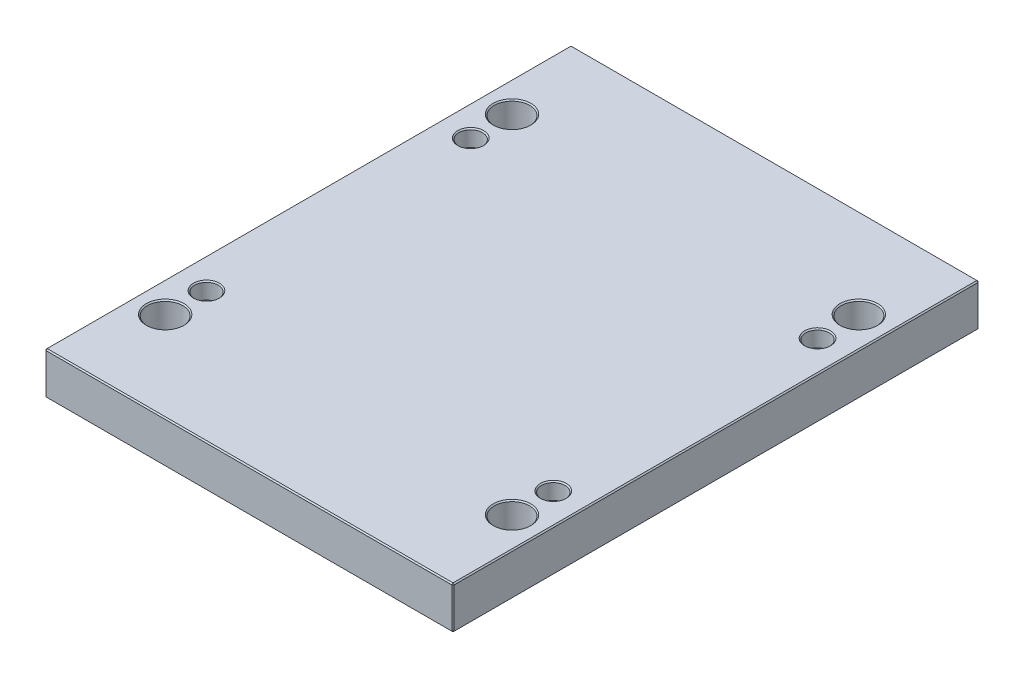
ISO-10303-21;
HEADER;
FILE_DESCRIPTION(('STEP AP214'),'2;1');
FILE_NAME('part.step','',(''),(''),'','','');
FILE_SCHEMA(('AUTOMOTIVE_DESIGN { 1 0 10303 214 1 1 1 1 }'));
ENDSEC;
DATA;
#1=APPLICATION_CONTEXT('core data for automotive mechanical design processes');
#2=APPLICATION_PROTOCOL_DEFINITION('international standard','automotive_design',2000,#1);
#3=PRODUCT_CONTEXT('',#1,'mechanical');
#4=PRODUCT('Part','Part','',(#3));
#5=PRODUCT_RELATED_PRODUCT_CATEGORY('part','',(#4));
#6=PRODUCT_DEFINITION_FORMATION('','',#4);
#7=PRODUCT_DEFINITION_CONTEXT('part definition',#1,'design');
#8=PRODUCT_DEFINITION('design','',#6,#7);
#9=PRODUCT_DEFINITION_SHAPE('','',#8);
#10=(LENGTH_UNIT() NAMED_UNIT(*) SI_UNIT(.MILLI.,.METRE.));
#11=(NAMED_UNIT(*) PLANE_ANGLE_UNIT() SI_UNIT($,.RADIAN.));
#12=(NAMED_UNIT(*) SI_UNIT($,.STERADIAN.) SOLID_ANGLE_UNIT());
#13=UNCERTAINTY_MEASURE_WITH_UNIT(LENGTH_MEASURE(1.E-05),#10,'distance_accuracy_value','');
#14=(GEOMETRIC_REPRESENTATION_CONTEXT(3) GLOBAL_UNCERTAINTY_ASSIGNED_CONTEXT((#13)) GLOBAL_UNIT_ASSIGNED_CONTEXT((#10,
#11,#12)) REPRESENTATION_CONTEXT('',''));
#15=CARTESIAN_POINT('',(0.,0.,0.));
#16=DIRECTION('',(0.,0.,1.));
#17=DIRECTION('',(1.,0.,0.));
#18=AXIS2_PLACEMENT_3D('',#15,#16,#17);
#19=CARTESIAN_POINT('',(-173.,36.,223.));
#20=DIRECTION('',(1.,0.,0.));
#21=DIRECTION('',(0.,0.,-1.));
#22=AXIS2_PLACEMENT_3D('',#19,#20,#21);
#23=PLANE('',#22);
#24=DIRECTION('',(0.,-1.,0.));
#25=VECTOR('',#24,1.);
#26=CARTESIAN_POINT('',(-173.,36.,-222.));
#27=LINE('',#26,#25);
#28=CARTESIAN_POINT('',(-173.,35.,-222.));
#29=VERTEX_POINT('',#28);
#30=CARTESIAN_POINT('',(-173.,1.,-222.));
#31=VERTEX_POINT('',#30);
#32=EDGE_CURVE('E115',#29,#31,#27,.T.);
#33=ORIENTED_EDGE('',*,*,#32,.T.);
#34=DIRECTION('',(0.,0.,1.));
#35=VECTOR('',#34,1.);
#36=CARTESIAN_POINT('',(-173.,1.,223.));
#37=LINE('',#36,#35);
#38=CARTESIAN_POINT('',(-173.,1.,222.));
#39=VERTEX_POINT('',#38);
#40=EDGE_CURVE('E111',#31,#39,#37,.T.);
#41=ORIENTED_EDGE('',*,*,#40,.T.);
#42=DIRECTION('',(0.,1.,0.));
#43=VECTOR('',#42,1.);
#44=CARTESIAN_POINT('',(-173.,36.,222.));
#45=LINE('',#44,#43);
#46=CARTESIAN_POINT('',(-173.,35.,222.));
#47=VERTEX_POINT('',#46);
#48=EDGE_CURVE('E104',#39,#47,#45,.T.);
#49=ORIENTED_EDGE('',*,*,#48,.T.);
#50=DIRECTION('',(0.,0.,-1.));
#51=VECTOR('',#50,1.);
#52=CARTESIAN_POINT('',(-173.,35.,-223.));
#53=LINE('',#52,#51);
#54=EDGE_CURVE('E108',#47,#29,#53,.T.);
#55=ORIENTED_EDGE('',*,*,#54,.T.);
#56=EDGE_LOOP('',(#33,#41,#49,#55));
#57=FACE_BOUND('',#56,.T.);
#58=ADVANCED_FACE('F16',(#57),#23,.F.);
#59=CARTESIAN_POINT('',(173.,36.,223.));
#60=DIRECTION('',(0.,0.,-1.));
#61=DIRECTION('',(-1.,0.,0.));
#62=AXIS2_PLACEMENT_3D('',#59,#60,#61);
#63=PLANE('',#62);
#64=DIRECTION('',(-1.,0.,0.));
#65=VECTOR('',#64,1.);
#66=CARTESIAN_POINT('',(-173.,35.,223.));
#67=LINE('',#66,#65);
#68=CARTESIAN_POINT('',(172.,35.,223.));
#69=VERTEX_POINT('',#68);
#70=CARTESIAN_POINT('',(-172.,35.,223.));
#71=VERTEX_POINT('',#70);
#72=EDGE_CURVE('E170',#69,#71,#67,.T.);
#73=ORIENTED_EDGE('',*,*,#72,.T.);
#74=DIRECTION('',(0.,-1.,0.));
#75=VECTOR('',#74,1.);
#76=CARTESIAN_POINT('',(-172.,36.,223.));
#77=LINE('',#76,#75);
#78=CARTESIAN_POINT('',(-172.,1.,223.));
#79=VERTEX_POINT('',#78);
#80=EDGE_CURVE('E123',#71,#79,#77,.T.);
#81=ORIENTED_EDGE('',*,*,#80,.T.);
#82=DIRECTION('',(1.,0.,0.));
#83=VECTOR('',#82,1.);
#84=CARTESIAN_POINT('',(173.,1.,223.));
#85=LINE('',#84,#83);
#86=CARTESIAN_POINT('',(172.,1.,223.));
#87=VERTEX_POINT('',#86);
#88=EDGE_CURVE('E174',#79,#87,#85,.T.);
#89=ORIENTED_EDGE('',*,*,#88,.T.);
#90=DIRECTION('',(0.,1.,0.));
#91=VECTOR('',#90,1.);
#92=CARTESIAN_POINT('',(172.,36.,223.));
#93=LINE('',#92,#91);
#94=EDGE_CURVE('E172',#87,#69,#93,.T.);
#95=ORIENTED_EDGE('',*,*,#94,.T.);
#96=EDGE_LOOP('',(#73,#81,#89,#95));
#97=FACE_BOUND('',#96,.T.);
#98=ADVANCED_FACE('F413',(#97),#63,.F.);
#99=CARTESIAN_POINT('',(173.,36.,223.));
#100=DIRECTION('',(-1.,0.,0.));
#101=DIRECTION('',(0.,0.,1.));
#102=AXIS2_PLACEMENT_3D('',#99,#100,#101);
#103=PLANE('',#102);
#104=DIRECTION('',(0.,0.,-1.));
#105=VECTOR('',#104,1.);
#106=CARTESIAN_POINT('',(173.,1.,223.));
#107=LINE('',#106,#105);
#108=CARTESIAN_POINT('',(173.,1.,222.));
#109=VERTEX_POINT('',#108);
#110=CARTESIAN_POINT('',(173.,1.,-222.));
#111=VERTEX_POINT('',#110);
#112=EDGE_CURVE('E165',#109,#111,#107,.T.);
#113=ORIENTED_EDGE('',*,*,#112,.T.);
#114=DIRECTION('',(0.,1.,0.));
#115=VECTOR('',#114,1.);
#116=CARTESIAN_POINT('',(173.,36.,-222.));
#117=LINE('',#116,#115);
#118=CARTESIAN_POINT('',(173.,35.,-222.));
#119=VERTEX_POINT('',#118);
#120=EDGE_CURVE('E167',#111,#119,#117,.T.);
#121=ORIENTED_EDGE('',*,*,#120,.T.);
#122=DIRECTION('',(0.,0.,1.));
#123=VECTOR('',#122,1.);
#124=CARTESIAN_POINT('',(173.,35.,223.));
#125=LINE('',#124,#123);
#126=CARTESIAN_POINT('',(173.,35.,222.));
#127=VERTEX_POINT('',#126);
#128=EDGE_CURVE('E161',#119,#127,#125,.T.);
#129=ORIENTED_EDGE('',*,*,#128,.T.);
#130=DIRECTION('',(0.,-1.,0.));
#131=VECTOR('',#130,1.);
#132=CARTESIAN_POINT('',(173.,36.,222.));
#133=LINE('',#132,#131);
#134=EDGE_CURVE('E163',#127,#109,#133,.T.);
#135=ORIENTED_EDGE('',*,*,#134,.T.);
#136=EDGE_LOOP('',(#113,#121,#129,#135));
#137=FACE_BOUND('',#136,.T.);
#138=ADVANCED_FACE('F406',(#137),#103,.F.);
#139=CARTESIAN_POINT('',(173.,36.,-223.));
#140=DIRECTION('',(0.,0.,1.));
#141=DIRECTION('',(1.,0.,0.));
#142=AXIS2_PLACEMENT_3D('',#139,#140,#141);
#143=PLANE('',#142);
#144=DIRECTION('',(0.,-1.,0.));
#145=VECTOR('',#144,1.);
#146=CARTESIAN_POINT('',(172.,36.,-223.));
#147=LINE('',#146,#145);
#148=CARTESIAN_POINT('',(172.,35.,-223.));
#149=VERTEX_POINT('',#148);
#150=CARTESIAN_POINT('',(172.,1.,-223.));
#151=VERTEX_POINT('',#150);
#152=EDGE_CURVE('E154',#149,#151,#147,.T.);
#153=ORIENTED_EDGE('',*,*,#152,.T.);
#154=DIRECTION('',(-1.,0.,0.));
#155=VECTOR('',#154,1.);
#156=CARTESIAN_POINT('',(173.,1.,-223.));
#157=LINE('',#156,#155);
#158=CARTESIAN_POINT('',(-172.,1.,-223.));
#159=VERTEX_POINT('',#158);
#160=EDGE_CURVE('E159',#151,#159,#157,.T.);
#161=ORIENTED_EDGE('',*,*,#160,.T.);
#162=DIRECTION('',(0.,1.,0.));
#163=VECTOR('',#162,1.);
#164=CARTESIAN_POINT('',(-172.,36.,-223.));
#165=LINE('',#164,#163);
#166=CARTESIAN_POINT('',(-172.,35.,-223.));
#167=VERTEX_POINT('',#166);
#168=EDGE_CURVE('E156',#159,#167,#165,.T.);
#169=ORIENTED_EDGE('',*,*,#168,.T.);
#170=DIRECTION('',(1.,0.,0.));
#171=VECTOR('',#170,1.);
#172=CARTESIAN_POINT('',(173.,35.,-223.));
#173=LINE('',#172,#171);
#174=EDGE_CURVE('E152',#167,#149,#173,.T.);
#175=ORIENTED_EDGE('',*,*,#174,.T.);
#176=EDGE_LOOP('',(#153,#161,#169,#175));
#177=FACE_BOUND('',#176,.T.);
#178=ADVANCED_FACE('F431',(#177),#143,.F.);
#179=CARTESIAN_POINT('',(0.,36.,0.));
#180=DIRECTION('',(0.,1.,0.));
#181=DIRECTION('',(0.,0.,1.));
#182=AXIS2_PLACEMENT_3D('',#179,#180,#181);
#183=PLANE('',#182);
#184=CARTESIAN_POINT('',(-147.,36.,147.));
#185=DIRECTION('',(0.,1.,0.));
#186=DIRECTION('',(0.,0.,1.));
#187=AXIS2_PLACEMENT_3D('',#184,#185,#186);
#188=CIRCLE('',#187,16.);
#189=CARTESIAN_POINT('',(-147.,36.,163.));
#190=VERTEX_POINT('',#189);
#191=EDGE_CURVE('E317',#190,#190,#188,.F.);
#192=ORIENTED_EDGE('',*,*,#191,.T.);
#193=EDGE_LOOP('',(#192));
#194=FACE_BOUND('',#193,.T.);
#195=CARTESIAN_POINT('',(147.,36.,147.));
#196=DIRECTION('',(0.,1.,0.));
#197=DIRECTION('',(0.,0.,1.));
#198=AXIS2_PLACEMENT_3D('',#195,#196,#197);
#199=CIRCLE('',#198,16.);
#200=CARTESIAN_POINT('',(147.,36.,163.));
#201=VERTEX_POINT('',#200);
#202=EDGE_CURVE('E314',#201,#201,#199,.F.);
#203=ORIENTED_EDGE('',*,*,#202,.T.);
#204=EDGE_LOOP('',(#203));
#205=FACE_BOUND('',#204,.T.);
#206=CARTESIAN_POINT('',(147.,36.,-147.));
#207=DIRECTION('',(0.,1.,0.));
#208=DIRECTION('',(0.,0.,1.));
#209=AXIS2_PLACEMENT_3D('',#206,#207,#208);
#210=CIRCLE('',#209,16.);
#211=CARTESIAN_POINT('',(147.,36.,-131.));
#212=VERTEX_POINT('',#211);
#213=EDGE_CURVE('E311',#212,#212,#210,.F.);
#214=ORIENTED_EDGE('',*,*,#213,.T.);
#215=EDGE_LOOP('',(#214));
#216=FACE_BOUND('',#215,.T.);
#217=CARTESIAN_POINT('',(-147.,36.,-147.));
#218=DIRECTION('',(0.,1.,0.));
#219=DIRECTION('',(0.,0.,1.));
#220=AXIS2_PLACEMENT_3D('',#217,#218,#219);
#221=CIRCLE('',#220,16.);
#222=CARTESIAN_POINT('',(-147.,36.,-131.));
#223=VERTEX_POINT('',#222);
#224=EDGE_CURVE('E308',#223,#223,#221,.F.);
#225=ORIENTED_EDGE('',*,*,#224,.T.);
#226=EDGE_LOOP('',(#225));
#227=FACE_BOUND('',#226,.T.);
#228=CARTESIAN_POINT('',(-147.,36.,112.));
#229=DIRECTION('',(0.,1.,0.));
#230=DIRECTION('',(0.,0.,1.));
#231=AXIS2_PLACEMENT_3D('',#228,#229,#230);
#232=CIRCLE('',#231,11.);
#233=CARTESIAN_POINT('',(-147.,36.,123.));
#234=VERTEX_POINT('',#233);
#235=EDGE_CURVE('E290',#234,#234,#232,.F.);
#236=ORIENTED_EDGE('',*,*,#235,.T.);
#237=EDGE_LOOP('',(#236));
#238=FACE_BOUND('',#237,.T.);
#239=CARTESIAN_POINT('',(147.,36.,112.));
#240=DIRECTION('',(0.,1.,0.));
#241=DIRECTION('',(0.,0.,1.));
#242=AXIS2_PLACEMENT_3D('',#239,#240,#241);
#243=CIRCLE('',#242,11.);
#244=CARTESIAN_POINT('',(147.,36.,123.));
#245=VERTEX_POINT('',#244);
#246=EDGE_CURVE('E287',#245,#245,#243,.F.);
#247=ORIENTED_EDGE('',*,*,#246,.T.);
#248=EDGE_LOOP('',(#247));
#249=FACE_BOUND('',#248,.T.);
#250=CARTESIAN_POINT('',(147.,36.,-112.));
#251=DIRECTION('',(0.,1.,0.));
#252=DIRECTION('',(0.,0.,1.));
#253=AXIS2_PLACEMENT_3D('',#250,#251,#252);
#254=CIRCLE('',#253,11.);
#255=CARTESIAN_POINT('',(147.,36.,-101.));
#256=VERTEX_POINT('',#255);
#257=EDGE_CURVE('E284',#256,#256,#254,.F.);
#258=ORIENTED_EDGE('',*,*,#257,.T.);
#259=EDGE_LOOP('',(#258));
#260=FACE_BOUND('',#259,.T.);
#261=CARTESIAN_POINT('',(-147.,36.,-112.));
#262=DIRECTION('',(0.,1.,0.));
#263=DIRECTION('',(0.,0.,1.));
#264=AXIS2_PLACEMENT_3D('',#261,#262,#263);
#265=CIRCLE('',#264,11.);
#266=CARTESIAN_POINT('',(-147.,36.,-101.));
#267=VERTEX_POINT('',#266);
#268=EDGE_CURVE('E281',#267,#267,#265,.F.);
#269=ORIENTED_EDGE('',*,*,#268,.T.);
#270=EDGE_LOOP('',(#269));
#271=FACE_BOUND('',#270,.T.);
#272=DIRECTION('',(0.,0.,-1.));
#273=VECTOR('',#272,1.);
#274=CARTESIAN_POINT('',(172.,36.,-223.));
#275=LINE('',#274,#273);
#276=CARTESIAN_POINT('',(172.,36.,222.));
#277=VERTEX_POINT('',#276);
#278=CARTESIAN_POINT('',(172.,36.,-222.));
#279=VERTEX_POINT('',#278);
#280=EDGE_CURVE('E31',#277,#279,#275,.T.);
#281=ORIENTED_EDGE('',*,*,#280,.T.);
#282=DIRECTION('',(-1.,0.,0.));
#283=VECTOR('',#282,1.);
#284=CARTESIAN_POINT('',(-173.,36.,-222.));
#285=LINE('',#284,#283);
#286=CARTESIAN_POINT('',(-172.,36.,-222.));
#287=VERTEX_POINT('',#286);
#288=EDGE_CURVE('E190',#279,#287,#285,.T.);
#289=ORIENTED_EDGE('',*,*,#288,.T.);
#290=DIRECTION('',(0.,0.,1.));
#291=VECTOR('',#290,1.);
#292=CARTESIAN_POINT('',(-172.,36.,223.));
#293=LINE('',#292,#291);
#294=CARTESIAN_POINT('',(-172.,36.,222.));
#295=VERTEX_POINT('',#294);
#296=EDGE_CURVE('E186',#287,#295,#293,.T.);
#297=ORIENTED_EDGE('',*,*,#296,.T.);
#298=DIRECTION('',(1.,0.,0.));
#299=VECTOR('',#298,1.);
#300=CARTESIAN_POINT('',(173.,36.,222.));
#301=LINE('',#300,#299);
#302=EDGE_CURVE('E36',#295,#277,#301,.T.);
#303=ORIENTED_EDGE('',*,*,#302,.T.);
#304=EDGE_LOOP('',(#281,#289,#297,#303));
#305=FACE_BOUND('',#304,.T.);
#306=ADVANCED_FACE('F357',(#194,#205,#216,#227,#238,#249,#260,#271,#305),#183,.T.);
#307=CARTESIAN_POINT('',(0.,0.,0.));
#308=DIRECTION('',(0.,1.,0.));
#309=DIRECTION('',(0.,0.,1.));
#310=AXIS2_PLACEMENT_3D('',#307,#308,#309);
#311=PLANE('',#310);
#312=CARTESIAN_POINT('',(-147.,0.,147.));
#313=DIRECTION('',(0.,1.,0.));
#314=DIRECTION('',(0.,0.,1.));
#315=AXIS2_PLACEMENT_3D('',#312,#313,#314);
#316=CIRCLE('',#315,16.);
#317=CARTESIAN_POINT('',(-147.,0.,163.));
#318=VERTEX_POINT('',#317);
#319=EDGE_CURVE('E329',#318,#318,#316,.T.);
#320=ORIENTED_EDGE('',*,*,#319,.T.);
#321=EDGE_LOOP('',(#320));
#322=FACE_BOUND('',#321,.T.);
#323=CARTESIAN_POINT('',(147.,0.,147.));
#324=DIRECTION('',(0.,1.,0.));
#325=DIRECTION('',(0.,0.,1.));
#326=AXIS2_PLACEMENT_3D('',#323,#324,#325);
#327=CIRCLE('',#326,16.);
#328=CARTESIAN_POINT('',(147.,0.,163.));
#329=VERTEX_POINT('',#328);
#330=EDGE_CURVE('E326',#329,#329,#327,.T.);
#331=ORIENTED_EDGE('',*,*,#330,.T.);
#332=EDGE_LOOP('',(#331));
#333=FACE_BOUND('',#332,.T.);
#334=CARTESIAN_POINT('',(147.,0.,-147.));
#335=DIRECTION('',(0.,1.,0.));
#336=DIRECTION('',(0.,0.,1.));
#337=AXIS2_PLACEMENT_3D('',#334,#335,#336);
#338=CIRCLE('',#337,16.);
#339=CARTESIAN_POINT('',(147.,0.,-131.));
#340=VERTEX_POINT('',#339);
#341=EDGE_CURVE('E323',#340,#340,#338,.T.);
#342=ORIENTED_EDGE('',*,*,#341,.T.);
#343=EDGE_LOOP('',(#342));
#344=FACE_BOUND('',#343,.T.);
#345=CARTESIAN_POINT('',(-147.,0.,-147.));
#346=DIRECTION('',(0.,1.,0.));
#347=DIRECTION('',(0.,0.,1.));
#348=AXIS2_PLACEMENT_3D('',#345,#346,#347);
#349=CIRCLE('',#348,16.);
#350=CARTESIAN_POINT('',(-147.,0.,-131.));
#351=VERTEX_POINT('',#350);
#352=EDGE_CURVE('E320',#351,#351,#349,.T.);
#353=ORIENTED_EDGE('',*,*,#352,.T.);
#354=EDGE_LOOP('',(#353));
#355=FACE_BOUND('',#354,.T.);
#356=CARTESIAN_POINT('',(147.,0.,-112.));
#357=DIRECTION('',(0.,1.,0.));
#358=DIRECTION('',(0.,0.,1.));
#359=AXIS2_PLACEMENT_3D('',#356,#357,#358);
#360=CIRCLE('',#359,8.);
#361=CARTESIAN_POINT('',(147.,0.,-104.));
#362=VERTEX_POINT('',#361);
#363=EDGE_CURVE('E263',#362,#362,#360,.T.);
#364=ORIENTED_EDGE('',*,*,#363,.T.);
#365=EDGE_LOOP('',(#364));
#366=FACE_BOUND('',#365,.T.);
#367=CARTESIAN_POINT('',(147.,0.,112.));
#368=DIRECTION('',(0.,1.,0.));
#369=DIRECTION('',(0.,0.,1.));
#370=AXIS2_PLACEMENT_3D('',#367,#368,#369);
#371=CIRCLE('',#370,8.);
#372=CARTESIAN_POINT('',(147.,0.,120.));
#373=VERTEX_POINT('',#372);
#374=EDGE_CURVE('E260',#373,#373,#371,.T.);
#375=ORIENTED_EDGE('',*,*,#374,.T.);
#376=EDGE_LOOP('',(#375));
#377=FACE_BOUND('',#376,.T.);
#378=CARTESIAN_POINT('',(-147.,0.,112.));
#379=DIRECTION('',(0.,1.,0.));
#380=DIRECTION('',(0.,0.,1.));
#381=AXIS2_PLACEMENT_3D('',#378,#379,#380);
#382=CIRCLE('',#381,8.);
#383=CARTESIAN_POINT('',(-147.,0.,120.));
#384=VERTEX_POINT('',#383);
#385=EDGE_CURVE('E257',#384,#384,#382,.T.);
#386=ORIENTED_EDGE('',*,*,#385,.T.);
#387=EDGE_LOOP('',(#386));
#388=FACE_BOUND('',#387,.T.);
#389=CARTESIAN_POINT('',(-147.,0.,-112.));
#390=DIRECTION('',(0.,1.,0.));
#391=DIRECTION('',(0.,0.,1.));
#392=AXIS2_PLACEMENT_3D('',#389,#390,#391);
#393=CIRCLE('',#392,8.);
#394=CARTESIAN_POINT('',(-147.,0.,-104.));
#395=VERTEX_POINT('',#394);
#396=EDGE_CURVE('E192',#395,#395,#393,.T.);
#397=ORIENTED_EDGE('',*,*,#396,.T.);
#398=EDGE_LOOP('',(#397));
#399=FACE_BOUND('',#398,.T.);
#400=DIRECTION('',(0.,0.,1.));
#401=VECTOR('',#400,1.);
#402=CARTESIAN_POINT('',(172.,0.,0.));
#403=LINE('',#402,#401);
#404=CARTESIAN_POINT('',(172.,0.,-222.));
#405=VERTEX_POINT('',#404);
#406=CARTESIAN_POINT('',(172.,0.,222.));
#407=VERTEX_POINT('',#406);
#408=EDGE_CURVE('E177',#405,#407,#403,.T.);
#409=ORIENTED_EDGE('',*,*,#408,.T.);
#410=DIRECTION('',(-1.,0.,0.));
#411=VECTOR('',#410,1.);
#412=CARTESIAN_POINT('',(0.,0.,222.));
#413=LINE('',#412,#411);
#414=CARTESIAN_POINT('',(-172.,0.,222.));
#415=VERTEX_POINT('',#414);
#416=EDGE_CURVE('E183',#407,#415,#413,.T.);
#417=ORIENTED_EDGE('',*,*,#416,.T.);
#418=DIRECTION('',(0.,0.,-1.));
#419=VECTOR('',#418,1.);
#420=CARTESIAN_POINT('',(-172.,0.,0.));
#421=LINE('',#420,#419);
#422=CARTESIAN_POINT('',(-172.,0.,-222.));
#423=VERTEX_POINT('',#422);
#424=EDGE_CURVE('E181',#415,#423,#421,.T.);
#425=ORIENTED_EDGE('',*,*,#424,.T.);
#426=DIRECTION('',(1.,0.,0.));
#427=VECTOR('',#426,1.);
#428=CARTESIAN_POINT('',(0.,0.,-222.));
#429=LINE('',#428,#427);
#430=EDGE_CURVE('E179',#423,#405,#429,.T.);
#431=ORIENTED_EDGE('',*,*,#430,.T.);
#432=EDGE_LOOP('',(#409,#417,#425,#431));
#433=FACE_BOUND('',#432,.T.);
#434=ADVANCED_FACE('F353',(#322,#333,#344,#355,#366,#377,#388,#399,#433),#311,.F.);
#435=CARTESIAN_POINT('',(173.,36.,222.));
#436=DIRECTION('',(-0.707106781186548,0.,-0.707106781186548));
#437=DIRECTION('',(0.,-1.,0.));
#438=AXIS2_PLACEMENT_3D('',#435,#436,#437);
#439=PLANE('',#438);
#440=DIRECTION('',(-0.707106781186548,0.,0.707106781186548));
#441=VECTOR('',#440,1.);
#442=CARTESIAN_POINT('',(172.,35.,223.));
#443=LINE('',#442,#441);
#444=EDGE_CURVE('E141',#69,#127,#443,.F.);
#445=ORIENTED_EDGE('',*,*,#444,.F.);
#446=ORIENTED_EDGE('',*,*,#94,.F.);
#447=DIRECTION('',(0.707106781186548,0.,-0.707106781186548));
#448=VECTOR('',#447,1.);
#449=CARTESIAN_POINT('',(172.,1.,223.));
#450=LINE('',#449,#448);
#451=EDGE_CURVE('E144',#109,#87,#450,.F.);
#452=ORIENTED_EDGE('',*,*,#451,.F.);
#453=ORIENTED_EDGE('',*,*,#134,.F.);
#454=EDGE_LOOP('',(#445,#446,#452,#453));
#455=FACE_BOUND('',#454,.T.);
#456=ADVANCED_FACE('F356',(#455),#439,.F.);
#457=CARTESIAN_POINT('',(172.,35.,223.));
#458=DIRECTION('',(0.577350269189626,0.577350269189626,0.577350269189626));
#459=DIRECTION('',(0.707106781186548,0.,-0.707106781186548));
#460=AXIS2_PLACEMENT_3D('',#457,#458,#459);
#461=PLANE('',#460);
#462=DIRECTION('',(0.,-0.707106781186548,0.707106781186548));
#463=VECTOR('',#462,1.);
#464=CARTESIAN_POINT('',(172.,35.,223.));
#465=LINE('',#464,#463);
#466=EDGE_CURVE('E235',#69,#277,#465,.F.);
#467=ORIENTED_EDGE('',*,*,#466,.F.);
#468=ORIENTED_EDGE('',*,*,#444,.T.);
#469=DIRECTION('',(-0.707106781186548,0.707106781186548,0.));
#470=VECTOR('',#469,1.);
#471=CARTESIAN_POINT('',(172.5,35.5,222.));
#472=LINE('',#471,#470);
#473=EDGE_CURVE('E237',#277,#127,#472,.F.);
#474=ORIENTED_EDGE('',*,*,#473,.F.);
#475=EDGE_LOOP('',(#467,#468,#474));
#476=FACE_BOUND('',#475,.T.);
#477=ADVANCED_FACE('F419',(#476),#461,.T.);
#478=CARTESIAN_POINT('',(172.,1.,223.));
#479=DIRECTION('',(0.577350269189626,-0.577350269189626,0.577350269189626));
#480=DIRECTION('',(0.707106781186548,0.,-0.707106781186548));
#481=AXIS2_PLACEMENT_3D('',#478,#479,#480);
#482=PLANE('',#481);
#483=DIRECTION('',(-0.707106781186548,-0.707106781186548,0.));
#484=VECTOR('',#483,1.);
#485=CARTESIAN_POINT('',(172.5,0.5,222.));
#486=LINE('',#485,#484);
#487=EDGE_CURVE('E229',#109,#407,#486,.T.);
#488=ORIENTED_EDGE('',*,*,#487,.F.);
#489=ORIENTED_EDGE('',*,*,#451,.T.);
#490=DIRECTION('',(0.,0.707106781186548,0.707106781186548));
#491=VECTOR('',#490,1.);
#492=CARTESIAN_POINT('',(172.,1.,223.));
#493=LINE('',#492,#491);
#494=EDGE_CURVE('E232',#407,#87,#493,.T.);
#495=ORIENTED_EDGE('',*,*,#494,.F.);
#496=EDGE_LOOP('',(#488,#489,#495));
#497=FACE_BOUND('',#496,.T.);
#498=ADVANCED_FACE('F378',(#497),#482,.T.);
#499=CARTESIAN_POINT('',(172.,36.,0.));
#500=DIRECTION('',(0.707106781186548,0.707106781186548,0.));
#501=DIRECTION('',(0.,0.,1.));
#502=AXIS2_PLACEMENT_3D('',#499,#500,#501);
#503=PLANE('',#502);
#504=ORIENTED_EDGE('',*,*,#473,.T.);
#505=ORIENTED_EDGE('',*,*,#128,.F.);
#506=DIRECTION('',(0.707106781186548,-0.707106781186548,0.));
#507=VECTOR('',#506,1.);
#508=CARTESIAN_POINT('',(173.,35.,-222.));
#509=LINE('',#508,#507);
#510=EDGE_CURVE('E224',#279,#119,#509,.T.);
#511=ORIENTED_EDGE('',*,*,#510,.F.);
#512=ORIENTED_EDGE('',*,*,#280,.F.);
#513=EDGE_LOOP('',(#504,#505,#511,#512));
#514=FACE_BOUND('',#513,.T.);
#515=ADVANCED_FACE('F421',(#514),#503,.T.);
#516=CARTESIAN_POINT('',(0.,36.,222.));
#517=DIRECTION('',(0.,0.707106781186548,0.707106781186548));
#518=DIRECTION('',(-1.,0.,0.));
#519=AXIS2_PLACEMENT_3D('',#516,#517,#518);
#520=PLANE('',#519);
#521=ORIENTED_EDGE('',*,*,#466,.T.);
#522=ORIENTED_EDGE('',*,*,#302,.F.);
#523=DIRECTION('',(0.,0.707106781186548,-0.707106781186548));
#524=VECTOR('',#523,1.);
#525=CARTESIAN_POINT('',(-172.,35.5,222.5));
#526=LINE('',#525,#524);
#527=EDGE_CURVE('E127',#71,#295,#526,.T.);
#528=ORIENTED_EDGE('',*,*,#527,.F.);
#529=ORIENTED_EDGE('',*,*,#72,.F.);
#530=EDGE_LOOP('',(#521,#522,#528,#529));
#531=FACE_BOUND('',#530,.T.);
#532=ADVANCED_FACE('F416',(#531),#520,.T.);
#533=CARTESIAN_POINT('',(-172.,36.,223.));
#534=DIRECTION('',(0.707106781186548,0.,-0.707106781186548));
#535=DIRECTION('',(0.,-1.,0.));
#536=AXIS2_PLACEMENT_3D('',#533,#534,#535);
#537=PLANE('',#536);
#538=DIRECTION('',(0.707106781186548,0.,0.707106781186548));
#539=VECTOR('',#538,1.);
#540=CARTESIAN_POINT('',(-172.,1.,223.));
#541=LINE('',#540,#539);
#542=EDGE_CURVE('E128',#79,#39,#541,.F.);
#543=ORIENTED_EDGE('',*,*,#542,.F.);
#544=ORIENTED_EDGE('',*,*,#80,.F.);
#545=DIRECTION('',(-0.707106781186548,0.,-0.707106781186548));
#546=VECTOR('',#545,1.);
#547=CARTESIAN_POINT('',(-173.,35.,222.));
#548=LINE('',#547,#546);
#549=EDGE_CURVE('E119',#47,#71,#548,.F.);
#550=ORIENTED_EDGE('',*,*,#549,.F.);
#551=ORIENTED_EDGE('',*,*,#48,.F.);
#552=EDGE_LOOP('',(#543,#544,#550,#551));
#553=FACE_BOUND('',#552,.T.);
#554=ADVANCED_FACE('F121',(#553),#537,.F.);
#555=CARTESIAN_POINT('',(173.,1.,223.));
#556=DIRECTION('',(0.,0.707106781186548,-0.707106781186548));
#557=DIRECTION('',(1.,0.,0.));
#558=AXIS2_PLACEMENT_3D('',#555,#556,#557);
#559=PLANE('',#558);
#560=ORIENTED_EDGE('',*,*,#494,.T.);
#561=ORIENTED_EDGE('',*,*,#88,.F.);
#562=DIRECTION('',(0.,-0.707106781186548,-0.707106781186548));
#563=VECTOR('',#562,1.);
#564=CARTESIAN_POINT('',(-172.,1.,223.));
#565=LINE('',#564,#563);
#566=EDGE_CURVE('E220',#415,#79,#565,.F.);
#567=ORIENTED_EDGE('',*,*,#566,.F.);
#568=ORIENTED_EDGE('',*,*,#416,.F.);
#569=EDGE_LOOP('',(#560,#561,#567,#568));
#570=FACE_BOUND('',#569,.T.);
#571=ADVANCED_FACE('F383',(#570),#559,.F.);
#572=CARTESIAN_POINT('',(173.,1.,223.));
#573=DIRECTION('',(-0.707106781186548,0.707106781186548,0.));
#574=DIRECTION('',(0.,0.,-1.));
#575=AXIS2_PLACEMENT_3D('',#572,#573,#574);
#576=PLANE('',#575);
#577=ORIENTED_EDGE('',*,*,#487,.T.);
#578=ORIENTED_EDGE('',*,*,#408,.F.);
#579=DIRECTION('',(0.707106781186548,0.707106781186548,0.));
#580=VECTOR('',#579,1.);
#581=CARTESIAN_POINT('',(172.5,0.500000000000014,-222.));
#582=LINE('',#581,#580);
#583=EDGE_CURVE('E217',#111,#405,#582,.F.);
#584=ORIENTED_EDGE('',*,*,#583,.F.);
#585=ORIENTED_EDGE('',*,*,#112,.F.);
#586=EDGE_LOOP('',(#577,#578,#584,#585));
#587=FACE_BOUND('',#586,.T.);
#588=ADVANCED_FACE('F376',(#587),#576,.F.);
#589=CARTESIAN_POINT('',(172.,36.,-223.));
#590=DIRECTION('',(-0.707106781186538,0.,0.707106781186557));
#591=DIRECTION('',(0.,-1.,0.));
#592=AXIS2_PLACEMENT_3D('',#589,#590,#591);
#593=PLANE('',#592);
#594=DIRECTION('',(0.707106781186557,0.,0.707106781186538));
#595=VECTOR('',#594,1.);
#596=CARTESIAN_POINT('',(173.,35.,-222.));
#597=LINE('',#596,#595);
#598=EDGE_CURVE('E226',#119,#149,#597,.F.);
#599=ORIENTED_EDGE('',*,*,#598,.F.);
#600=ORIENTED_EDGE('',*,*,#120,.F.);
#601=DIRECTION('',(-0.707106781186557,0.,-0.707106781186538));
#602=VECTOR('',#601,1.);
#603=CARTESIAN_POINT('',(172.,1.,-223.));
#604=LINE('',#603,#602);
#605=EDGE_CURVE('E214',#151,#111,#604,.F.);
#606=ORIENTED_EDGE('',*,*,#605,.F.);
#607=ORIENTED_EDGE('',*,*,#152,.F.);
#608=EDGE_LOOP('',(#599,#600,#606,#607));
#609=FACE_BOUND('',#608,.T.);
#610=ADVANCED_FACE('F403',(#609),#593,.F.);
#611=CARTESIAN_POINT('',(173.,35.,-222.));
#612=DIRECTION('',(0.57735026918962,0.57735026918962,-0.577350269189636));
#613=DIRECTION('',(-0.707106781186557,0.,-0.707106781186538));
#614=AXIS2_PLACEMENT_3D('',#611,#612,#613);
#615=PLANE('',#614);
#616=ORIENTED_EDGE('',*,*,#510,.T.);
#617=ORIENTED_EDGE('',*,*,#598,.T.);
#618=DIRECTION('',(0.,0.707106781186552,0.707106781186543));
#619=VECTOR('',#618,1.);
#620=CARTESIAN_POINT('',(172.,35.5,-222.5));
#621=LINE('',#620,#619);
#622=EDGE_CURVE('E135',#279,#149,#621,.F.);
#623=ORIENTED_EDGE('',*,*,#622,.F.);
#624=EDGE_LOOP('',(#616,#617,#623));
#625=FACE_BOUND('',#624,.T.);
#626=ADVANCED_FACE('F425',(#625),#615,.T.);
#627=CARTESIAN_POINT('',(-173.,35.,222.));
#628=DIRECTION('',(-0.577350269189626,0.577350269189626,0.577350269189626));
#629=DIRECTION('',(0.707106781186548,0.,0.707106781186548));
#630=AXIS2_PLACEMENT_3D('',#627,#628,#629);
#631=PLANE('',#630);
#632=ORIENTED_EDGE('',*,*,#549,.T.);
#633=ORIENTED_EDGE('',*,*,#527,.T.);
#634=DIRECTION('',(-0.707106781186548,-0.707106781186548,0.));
#635=VECTOR('',#634,1.);
#636=CARTESIAN_POINT('',(-173.,35.,222.));
#637=LINE('',#636,#635);
#638=EDGE_CURVE('E131',#47,#295,#637,.F.);
#639=ORIENTED_EDGE('',*,*,#638,.F.);
#640=EDGE_LOOP('',(#632,#633,#639));
#641=FACE_BOUND('',#640,.T.);
#642=ADVANCED_FACE('F132',(#641),#631,.T.);
#643=CARTESIAN_POINT('',(-172.,1.,223.));
#644=DIRECTION('',(-0.577350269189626,-0.577350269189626,0.577350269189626));
#645=DIRECTION('',(0.707106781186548,0.,0.707106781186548));
#646=AXIS2_PLACEMENT_3D('',#643,#644,#645);
#647=PLANE('',#646);
#648=ORIENTED_EDGE('',*,*,#566,.T.);
#649=ORIENTED_EDGE('',*,*,#542,.T.);
#650=DIRECTION('',(-0.707106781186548,0.707106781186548,0.));
#651=VECTOR('',#650,1.);
#652=CARTESIAN_POINT('',(-172.5,0.5,222.));
#653=LINE('',#652,#651);
#654=EDGE_CURVE('E136',#415,#39,#653,.T.);
#655=ORIENTED_EDGE('',*,*,#654,.F.);
#656=EDGE_LOOP('',(#648,#649,#655));
#657=FACE_BOUND('',#656,.T.);
#658=ADVANCED_FACE('F386',(#657),#647,.T.);
#659=CARTESIAN_POINT('',(172.,1.,-223.));
#660=DIRECTION('',(0.577350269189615,-0.577350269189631,-0.577350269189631));
#661=DIRECTION('',(0.,0.707106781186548,-0.707106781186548));
#662=AXIS2_PLACEMENT_3D('',#659,#660,#661);
#663=PLANE('',#662);
#664=ORIENTED_EDGE('',*,*,#605,.T.);
#665=ORIENTED_EDGE('',*,*,#583,.T.);
#666=DIRECTION('',(0.,-0.707106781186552,0.707106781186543));
#667=VECTOR('',#666,1.);
#668=CARTESIAN_POINT('',(172.,1.,-223.));
#669=LINE('',#668,#667);
#670=EDGE_CURVE('E207',#151,#405,#669,.T.);
#671=ORIENTED_EDGE('',*,*,#670,.F.);
#672=EDGE_LOOP('',(#664,#665,#671));
#673=FACE_BOUND('',#672,.T.);
#674=ADVANCED_FACE('F397',(#673),#663,.T.);
#675=CARTESIAN_POINT('',(0.,36.,-222.));
#676=DIRECTION('',(0.,0.707106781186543,-0.707106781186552));
#677=DIRECTION('',(1.,0.,0.));
#678=AXIS2_PLACEMENT_3D('',#675,#676,#677);
#679=PLANE('',#678);
#680=ORIENTED_EDGE('',*,*,#622,.T.);
#681=ORIENTED_EDGE('',*,*,#174,.F.);
#682=DIRECTION('',(0.,-0.707106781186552,-0.707106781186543));
#683=VECTOR('',#682,1.);
#684=CARTESIAN_POINT('',(-172.,35.,-223.));
#685=LINE('',#684,#683);
#686=EDGE_CURVE('E204',#287,#167,#685,.T.);
#687=ORIENTED_EDGE('',*,*,#686,.F.);
#688=ORIENTED_EDGE('',*,*,#288,.F.);
#689=EDGE_LOOP('',(#680,#681,#687,#688));
#690=FACE_BOUND('',#689,.T.);
#691=ADVANCED_FACE('F429',(#690),#679,.T.);
#692=CARTESIAN_POINT('',(-172.,36.,0.));
#693=DIRECTION('',(-0.707106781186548,0.707106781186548,0.));
#694=DIRECTION('',(0.,0.,-1.));
#695=AXIS2_PLACEMENT_3D('',#692,#693,#694);
#696=PLANE('',#695);
#697=ORIENTED_EDGE('',*,*,#638,.T.);
#698=ORIENTED_EDGE('',*,*,#296,.F.);
#699=DIRECTION('',(0.707106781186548,0.707106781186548,0.));
#700=VECTOR('',#699,1.);
#701=CARTESIAN_POINT('',(-172.5,35.5,-222.));
#702=LINE('',#701,#700);
#703=EDGE_CURVE('E139',#29,#287,#702,.T.);
#704=ORIENTED_EDGE('',*,*,#703,.F.);
#705=ORIENTED_EDGE('',*,*,#54,.F.);
#706=EDGE_LOOP('',(#697,#698,#704,#705));
#707=FACE_BOUND('',#706,.T.);
#708=ADVANCED_FACE('F138',(#707),#696,.T.);
#709=CARTESIAN_POINT('',(-173.,1.,223.));
#710=DIRECTION('',(0.707106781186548,0.707106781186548,0.));
#711=DIRECTION('',(0.,0.,1.));
#712=AXIS2_PLACEMENT_3D('',#709,#710,#711);
#713=PLANE('',#712);
#714=ORIENTED_EDGE('',*,*,#654,.T.);
#715=ORIENTED_EDGE('',*,*,#40,.F.);
#716=DIRECTION('',(0.707106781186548,-0.707106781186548,0.));
#717=VECTOR('',#716,1.);
#718=CARTESIAN_POINT('',(-173.,1.,-222.));
#719=LINE('',#718,#717);
#720=EDGE_CURVE('E200',#423,#31,#719,.F.);
#721=ORIENTED_EDGE('',*,*,#720,.F.);
#722=ORIENTED_EDGE('',*,*,#424,.F.);
#723=EDGE_LOOP('',(#714,#715,#721,#722));
#724=FACE_BOUND('',#723,.T.);
#725=ADVANCED_FACE('F388',(#724),#713,.F.);
#726=CARTESIAN_POINT('',(173.,1.,-223.));
#727=DIRECTION('',(0.,0.707106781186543,0.707106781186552));
#728=DIRECTION('',(-1.,0.,0.));
#729=AXIS2_PLACEMENT_3D('',#726,#727,#728);
#730=PLANE('',#729);
#731=ORIENTED_EDGE('',*,*,#670,.T.);
#732=ORIENTED_EDGE('',*,*,#430,.F.);
#733=DIRECTION('',(0.,0.707106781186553,-0.707106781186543));
#734=VECTOR('',#733,1.);
#735=CARTESIAN_POINT('',(-172.,0.500000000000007,-222.5));
#736=LINE('',#735,#734);
#737=EDGE_CURVE('E197',#159,#423,#736,.F.);
#738=ORIENTED_EDGE('',*,*,#737,.F.);
#739=ORIENTED_EDGE('',*,*,#160,.F.);
#740=EDGE_LOOP('',(#731,#732,#738,#739));
#741=FACE_BOUND('',#740,.T.);
#742=ADVANCED_FACE('F392',(#741),#730,.F.);
#743=CARTESIAN_POINT('',(-172.,35.,-223.));
#744=DIRECTION('',(-0.577350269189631,0.577350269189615,-0.577350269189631));
#745=DIRECTION('',(-0.707106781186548,0.,0.707106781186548));
#746=AXIS2_PLACEMENT_3D('',#743,#744,#745);
#747=PLANE('',#746);
#748=ORIENTED_EDGE('',*,*,#703,.T.);
#749=ORIENTED_EDGE('',*,*,#686,.T.);
#750=DIRECTION('',(0.707106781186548,0.,-0.707106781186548));
#751=VECTOR('',#750,1.);
#752=CARTESIAN_POINT('',(-172.,35.,-223.));
#753=LINE('',#752,#751);
#754=EDGE_CURVE('E195',#29,#167,#753,.T.);
#755=ORIENTED_EDGE('',*,*,#754,.F.);
#756=EDGE_LOOP('',(#748,#749,#755));
#757=FACE_BOUND('',#756,.T.);
#758=ADVANCED_FACE('F460',(#757),#747,.T.);
#759=CARTESIAN_POINT('',(-173.,1.,-222.));
#760=DIRECTION('',(-0.577350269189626,-0.577350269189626,-0.577350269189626));
#761=DIRECTION('',(-0.707106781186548,0.,0.707106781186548));
#762=AXIS2_PLACEMENT_3D('',#759,#760,#761);
#763=PLANE('',#762);
#764=ORIENTED_EDGE('',*,*,#737,.T.);
#765=ORIENTED_EDGE('',*,*,#720,.T.);
#766=DIRECTION('',(-0.707106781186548,0.,0.707106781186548));
#767=VECTOR('',#766,1.);
#768=CARTESIAN_POINT('',(-173.,1.,-222.));
#769=LINE('',#768,#767);
#770=EDGE_CURVE('E193',#159,#31,#769,.T.);
#771=ORIENTED_EDGE('',*,*,#770,.F.);
#772=EDGE_LOOP('',(#764,#765,#771));
#773=FACE_BOUND('',#772,.T.);
#774=ADVANCED_FACE('F456',(#773),#763,.T.);
#775=CARTESIAN_POINT('',(-173.,36.,-222.));
#776=DIRECTION('',(0.707106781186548,0.,0.707106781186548));
#777=DIRECTION('',(0.,-1.,0.));
#778=AXIS2_PLACEMENT_3D('',#775,#776,#777);
#779=PLANE('',#778);
#780=ORIENTED_EDGE('',*,*,#754,.T.);
#781=ORIENTED_EDGE('',*,*,#168,.F.);
#782=ORIENTED_EDGE('',*,*,#770,.T.);
#783=ORIENTED_EDGE('',*,*,#32,.F.);
#784=EDGE_LOOP('',(#780,#781,#782,#783));
#785=FACE_BOUND('',#784,.T.);
#786=ADVANCED_FACE('F452',(#785),#779,.F.);
#787=CARTESIAN_POINT('',(-147.,22.,-112.));
#788=DIRECTION('',(0.,1.,0.));
#789=DIRECTION('',(0.,0.,1.));
#790=AXIS2_PLACEMENT_3D('',#787,#788,#789);
#791=CYLINDRICAL_SURFACE('',#790,10.);
#792=CARTESIAN_POINT('',(-147.,35.,-112.));
#793=DIRECTION('',(0.,1.,0.));
#794=DIRECTION('',(0.,0.,1.));
#795=AXIS2_PLACEMENT_3D('',#792,#793,#794);
#796=CIRCLE('',#795,10.);
#797=CARTESIAN_POINT('',(-147.,35.,-102.));
#798=VERTEX_POINT('',#797);
#799=EDGE_CURVE('E299',#798,#798,#796,.T.);
#800=ORIENTED_EDGE('',*,*,#799,.T.);
#801=EDGE_LOOP('',(#800));
#802=FACE_BOUND('',#801,.T.);
#803=CARTESIAN_POINT('',(-147.,22.,-112.));
#804=DIRECTION('',(0.,1.,0.));
#805=DIRECTION('',(0.,0.,1.));
#806=AXIS2_PLACEMENT_3D('',#803,#804,#805);
#807=CIRCLE('',#806,10.);
#808=CARTESIAN_POINT('',(-147.,22.,-102.));
#809=VERTEX_POINT('',#808);
#810=EDGE_CURVE('E147',#809,#809,#807,.T.);
#811=ORIENTED_EDGE('',*,*,#810,.F.);
#812=EDGE_LOOP('',(#811));
#813=FACE_BOUND('',#812,.T.);
#814=ADVANCED_FACE('F455',(#802,#813),#791,.F.);
#815=CARTESIAN_POINT('',(-147.,22.,-112.));
#816=DIRECTION('',(0.,1.,0.));
#817=DIRECTION('',(0.,0.,1.));
#818=AXIS2_PLACEMENT_3D('',#815,#816,#817);
#819=PLANE('',#818);
#820=CARTESIAN_POINT('',(-147.,22.,-112.));
#821=DIRECTION('',(0.,1.,0.));
#822=DIRECTION('',(0.,0.,1.));
#823=AXIS2_PLACEMENT_3D('',#820,#821,#822);
#824=CIRCLE('',#823,7.);
#825=CARTESIAN_POINT('',(-147.,22.,-105.));
#826=VERTEX_POINT('',#825);
#827=EDGE_CURVE('E251',#826,#826,#824,.T.);
#828=ORIENTED_EDGE('',*,*,#827,.F.);
#829=EDGE_LOOP('',(#828));
#830=FACE_BOUND('',#829,.T.);
#831=ORIENTED_EDGE('',*,*,#810,.T.);
#832=EDGE_LOOP('',(#831));
#833=FACE_BOUND('',#832,.T.);
#834=ADVANCED_FACE('F602',(#830,#833),#819,.T.);
#835=CARTESIAN_POINT('',(147.,22.,-112.));
#836=DIRECTION('',(0.,1.,0.));
#837=DIRECTION('',(0.,0.,1.));
#838=AXIS2_PLACEMENT_3D('',#835,#836,#837);
#839=CYLINDRICAL_SURFACE('',#838,10.);
#840=CARTESIAN_POINT('',(147.,35.,-112.));
#841=DIRECTION('',(0.,1.,0.));
#842=DIRECTION('',(0.,0.,1.));
#843=AXIS2_PLACEMENT_3D('',#840,#841,#842);
#844=CIRCLE('',#843,10.);
#845=CARTESIAN_POINT('',(147.,35.,-102.));
#846=VERTEX_POINT('',#845);
#847=EDGE_CURVE('E296',#846,#846,#844,.T.);
#848=ORIENTED_EDGE('',*,*,#847,.T.);
#849=EDGE_LOOP('',(#848));
#850=FACE_BOUND('',#849,.T.);
#851=CARTESIAN_POINT('',(147.,22.,-112.));
#852=DIRECTION('',(0.,1.,0.));
#853=DIRECTION('',(0.,0.,1.));
#854=AXIS2_PLACEMENT_3D('',#851,#852,#853);
#855=CIRCLE('',#854,10.);
#856=CARTESIAN_POINT('',(147.,22.,-102.));
#857=VERTEX_POINT('',#856);
#858=EDGE_CURVE('E630',#857,#857,#855,.T.);
#859=ORIENTED_EDGE('',*,*,#858,.F.);
#860=EDGE_LOOP('',(#859));
#861=FACE_BOUND('',#860,.T.);
#862=ADVANCED_FACE('F598',(#850,#861),#839,.F.);
#863=CARTESIAN_POINT('',(147.,22.,-112.));
#864=DIRECTION('',(0.,1.,0.));
#865=DIRECTION('',(0.,0.,1.));
#866=AXIS2_PLACEMENT_3D('',#863,#864,#865);
#867=PLANE('',#866);
#868=CARTESIAN_POINT('',(147.,22.,-112.));
#869=DIRECTION('',(0.,1.,0.));
#870=DIRECTION('',(0.,0.,1.));
#871=AXIS2_PLACEMENT_3D('',#868,#869,#870);
#872=CIRCLE('',#871,7.);
#873=CARTESIAN_POINT('',(147.,22.,-105.));
#874=VERTEX_POINT('',#873);
#875=EDGE_CURVE('E248',#874,#874,#872,.T.);
#876=ORIENTED_EDGE('',*,*,#875,.F.);
#877=EDGE_LOOP('',(#876));
#878=FACE_BOUND('',#877,.T.);
#879=ORIENTED_EDGE('',*,*,#858,.T.);
#880=EDGE_LOOP('',(#879));
#881=FACE_BOUND('',#880,.T.);
#882=ADVANCED_FACE('F594',(#878,#881),#867,.T.);
#883=CARTESIAN_POINT('',(147.,22.,112.));
#884=DIRECTION('',(0.,1.,0.));
#885=DIRECTION('',(0.,0.,1.));
#886=AXIS2_PLACEMENT_3D('',#883,#884,#885);
#887=CYLINDRICAL_SURFACE('',#886,10.);
#888=CARTESIAN_POINT('',(147.,35.,112.));
#889=DIRECTION('',(0.,1.,0.));
#890=DIRECTION('',(0.,0.,1.));
#891=AXIS2_PLACEMENT_3D('',#888,#889,#890);
#892=CIRCLE('',#891,10.);
#893=CARTESIAN_POINT('',(147.,35.,122.));
#894=VERTEX_POINT('',#893);
#895=EDGE_CURVE('E293',#894,#894,#892,.T.);
#896=ORIENTED_EDGE('',*,*,#895,.T.);
#897=EDGE_LOOP('',(#896));
#898=FACE_BOUND('',#897,.T.);
#899=CARTESIAN_POINT('',(147.,22.,112.));
#900=DIRECTION('',(0.,1.,0.));
#901=DIRECTION('',(0.,0.,1.));
#902=AXIS2_PLACEMENT_3D('',#899,#900,#901);
#903=CIRCLE('',#902,10.);
#904=CARTESIAN_POINT('',(147.,22.,122.));
#905=VERTEX_POINT('',#904);
#906=EDGE_CURVE('E632',#905,#905,#903,.T.);
#907=ORIENTED_EDGE('',*,*,#906,.F.);
#908=EDGE_LOOP('',(#907));
#909=FACE_BOUND('',#908,.T.);
#910=ADVANCED_FACE('F597',(#898,#909),#887,.F.);
#911=CARTESIAN_POINT('',(147.,22.,112.));
#912=DIRECTION('',(0.,1.,0.));
#913=DIRECTION('',(0.,0.,1.));
#914=AXIS2_PLACEMENT_3D('',#911,#912,#913);
#915=PLANE('',#914);
#916=CARTESIAN_POINT('',(147.,22.,112.));
#917=DIRECTION('',(0.,1.,0.));
#918=DIRECTION('',(0.,0.,1.));
#919=AXIS2_PLACEMENT_3D('',#916,#917,#918);
#920=CIRCLE('',#919,7.);
#921=CARTESIAN_POINT('',(147.,22.,119.));
#922=VERTEX_POINT('',#921);
#923=EDGE_CURVE('E245',#922,#922,#920,.T.);
#924=ORIENTED_EDGE('',*,*,#923,.F.);
#925=EDGE_LOOP('',(#924));
#926=FACE_BOUND('',#925,.T.);
#927=ORIENTED_EDGE('',*,*,#906,.T.);
#928=EDGE_LOOP('',(#927));
#929=FACE_BOUND('',#928,.T.);
#930=ADVANCED_FACE('F604',(#926,#929),#915,.T.);
#931=CARTESIAN_POINT('',(-147.,22.,112.));
#932=DIRECTION('',(0.,1.,0.));
#933=DIRECTION('',(0.,0.,1.));
#934=AXIS2_PLACEMENT_3D('',#931,#932,#933);
#935=CYLINDRICAL_SURFACE('',#934,10.);
#936=CARTESIAN_POINT('',(-147.,35.,112.));
#937=DIRECTION('',(0.,1.,0.));
#938=DIRECTION('',(0.,0.,1.));
#939=AXIS2_PLACEMENT_3D('',#936,#937,#938);
#940=CIRCLE('',#939,10.);
#941=CARTESIAN_POINT('',(-147.,35.,122.));
#942=VERTEX_POINT('',#941);
#943=EDGE_CURVE('E278',#942,#942,#940,.T.);
#944=ORIENTED_EDGE('',*,*,#943,.T.);
#945=EDGE_LOOP('',(#944));
#946=FACE_BOUND('',#945,.T.);
#947=CARTESIAN_POINT('',(-147.,22.,112.));
#948=DIRECTION('',(0.,1.,0.));
#949=DIRECTION('',(0.,0.,1.));
#950=AXIS2_PLACEMENT_3D('',#947,#948,#949);
#951=CIRCLE('',#950,10.);
#952=CARTESIAN_POINT('',(-147.,22.,122.));
#953=VERTEX_POINT('',#952);
#954=EDGE_CURVE('E254',#953,#953,#951,.T.);
#955=ORIENTED_EDGE('',*,*,#954,.F.);
#956=EDGE_LOOP('',(#955));
#957=FACE_BOUND('',#956,.T.);
#958=ADVANCED_FACE('F607',(#946,#957),#935,.F.);
#959=CARTESIAN_POINT('',(-147.,22.,112.));
#960=DIRECTION('',(0.,1.,0.));
#961=DIRECTION('',(0.,0.,1.));
#962=AXIS2_PLACEMENT_3D('',#959,#960,#961);
#963=PLANE('',#962);
#964=CARTESIAN_POINT('',(-147.,22.,112.));
#965=DIRECTION('',(0.,1.,0.));
#966=DIRECTION('',(0.,0.,1.));
#967=AXIS2_PLACEMENT_3D('',#964,#965,#966);
#968=CIRCLE('',#967,7.);
#969=CARTESIAN_POINT('',(-147.,22.,119.));
#970=VERTEX_POINT('',#969);
#971=EDGE_CURVE('E242',#970,#970,#968,.T.);
#972=ORIENTED_EDGE('',*,*,#971,.F.);
#973=EDGE_LOOP('',(#972));
#974=FACE_BOUND('',#973,.T.);
#975=ORIENTED_EDGE('',*,*,#954,.T.);
#976=EDGE_LOOP('',(#975));
#977=FACE_BOUND('',#976,.T.);
#978=ADVANCED_FACE('F589',(#974,#977),#963,.T.);
#979=CARTESIAN_POINT('',(-147.,0.,112.));
#980=DIRECTION('',(0.,1.,0.));
#981=DIRECTION('',(0.,0.,1.));
#982=AXIS2_PLACEMENT_3D('',#979,#980,#981);
#983=CYLINDRICAL_SURFACE('',#982,7.);
#984=CARTESIAN_POINT('',(-147.,1.00000000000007,112.));
#985=DIRECTION('',(0.,1.,0.));
#986=DIRECTION('',(0.,0.,1.));
#987=AXIS2_PLACEMENT_3D('',#984,#985,#986);
#988=CIRCLE('',#987,7.);
#989=CARTESIAN_POINT('',(-147.,1.00000000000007,119.));
#990=VERTEX_POINT('',#989);
#991=EDGE_CURVE('E272',#990,#990,#988,.F.);
#992=ORIENTED_EDGE('',*,*,#991,.T.);
#993=EDGE_LOOP('',(#992));
#994=FACE_BOUND('',#993,.T.);
#995=ORIENTED_EDGE('',*,*,#971,.T.);
#996=EDGE_LOOP('',(#995));
#997=FACE_BOUND('',#996,.T.);
#998=ADVANCED_FACE('F585',(#994,#997),#983,.F.);
#999=CARTESIAN_POINT('',(147.,0.,112.));
#1000=DIRECTION('',(0.,1.,0.));
#1001=DIRECTION('',(0.,0.,1.));
#1002=AXIS2_PLACEMENT_3D('',#999,#1000,#1001);
#1003=CYLINDRICAL_SURFACE('',#1002,7.);
#1004=CARTESIAN_POINT('',(147.,1.00000000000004,112.));
#1005=DIRECTION('',(0.,1.,0.));
#1006=DIRECTION('',(0.,0.,1.));
#1007=AXIS2_PLACEMENT_3D('',#1004,#1005,#1006);
#1008=CIRCLE('',#1007,7.);
#1009=CARTESIAN_POINT('',(147.,1.00000000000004,119.));
#1010=VERTEX_POINT('',#1009);
#1011=EDGE_CURVE('E269',#1010,#1010,#1008,.F.);
#1012=ORIENTED_EDGE('',*,*,#1011,.T.);
#1013=EDGE_LOOP('',(#1012));
#1014=FACE_BOUND('',#1013,.T.);
#1015=ORIENTED_EDGE('',*,*,#923,.T.);
#1016=EDGE_LOOP('',(#1015));
#1017=FACE_BOUND('',#1016,.T.);
#1018=ADVANCED_FACE('F581',(#1014,#1017),#1003,.F.);
#1019=CARTESIAN_POINT('',(147.,0.,-112.));
#1020=DIRECTION('',(0.,1.,0.));
#1021=DIRECTION('',(0.,0.,1.));
#1022=AXIS2_PLACEMENT_3D('',#1019,#1020,#1021);
#1023=CYLINDRICAL_SURFACE('',#1022,7.);
#1024=CARTESIAN_POINT('',(147.,1.00000000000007,-112.));
#1025=DIRECTION('',(0.,1.,0.));
#1026=DIRECTION('',(0.,0.,1.));
#1027=AXIS2_PLACEMENT_3D('',#1024,#1025,#1026);
#1028=CIRCLE('',#1027,7.);
#1029=CARTESIAN_POINT('',(147.,1.00000000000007,-105.));
#1030=VERTEX_POINT('',#1029);
#1031=EDGE_CURVE('E266',#1030,#1030,#1028,.F.);
#1032=ORIENTED_EDGE('',*,*,#1031,.T.);
#1033=EDGE_LOOP('',(#1032));
#1034=FACE_BOUND('',#1033,.T.);
#1035=ORIENTED_EDGE('',*,*,#875,.T.);
#1036=EDGE_LOOP('',(#1035));
#1037=FACE_BOUND('',#1036,.T.);
#1038=ADVANCED_FACE('F578',(#1034,#1037),#1023,.F.);
#1039=CARTESIAN_POINT('',(-147.,0.,-112.));
#1040=DIRECTION('',(0.,1.,0.));
#1041=DIRECTION('',(0.,0.,1.));
#1042=AXIS2_PLACEMENT_3D('',#1039,#1040,#1041);
#1043=CYLINDRICAL_SURFACE('',#1042,7.);
#1044=CARTESIAN_POINT('',(-147.,1.00000000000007,-112.));
#1045=DIRECTION('',(0.,1.,0.));
#1046=DIRECTION('',(0.,0.,1.));
#1047=AXIS2_PLACEMENT_3D('',#1044,#1045,#1046);
#1048=CIRCLE('',#1047,7.);
#1049=CARTESIAN_POINT('',(-147.,1.00000000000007,-105.));
#1050=VERTEX_POINT('',#1049);
#1051=EDGE_CURVE('E275',#1050,#1050,#1048,.F.);
#1052=ORIENTED_EDGE('',*,*,#1051,.T.);
#1053=EDGE_LOOP('',(#1052));
#1054=FACE_BOUND('',#1053,.T.);
#1055=ORIENTED_EDGE('',*,*,#827,.T.);
#1056=EDGE_LOOP('',(#1055));
#1057=FACE_BOUND('',#1056,.T.);
#1058=ADVANCED_FACE('F503',(#1054,#1057),#1043,.F.);
#1059=CARTESIAN_POINT('',(147.,0.,-112.));
#1060=DIRECTION('',(0.,-1.,0.));
#1061=DIRECTION('',(0.,0.,-1.));
#1062=AXIS2_PLACEMENT_3D('',#1059,#1060,#1061);
#1063=CONICAL_SURFACE('',#1062,8.,0.785398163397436);
#1064=ORIENTED_EDGE('',*,*,#1031,.F.);
#1065=EDGE_LOOP('',(#1064));
#1066=FACE_BOUND('',#1065,.T.);
#1067=ORIENTED_EDGE('',*,*,#363,.F.);
#1068=EDGE_LOOP('',(#1067));
#1069=FACE_BOUND('',#1068,.T.);
#1070=ADVANCED_FACE('F499',(#1066,#1069),#1063,.F.);
#1071=CARTESIAN_POINT('',(147.,0.,112.));
#1072=DIRECTION('',(0.,-1.,0.));
#1073=DIRECTION('',(0.,0.,-1.));
#1074=AXIS2_PLACEMENT_3D('',#1071,#1072,#1073);
#1075=CONICAL_SURFACE('',#1074,8.,0.785398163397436);
#1076=ORIENTED_EDGE('',*,*,#1011,.F.);
#1077=EDGE_LOOP('',(#1076));
#1078=FACE_BOUND('',#1077,.T.);
#1079=ORIENTED_EDGE('',*,*,#374,.F.);
#1080=EDGE_LOOP('',(#1079));
#1081=FACE_BOUND('',#1080,.T.);
#1082=ADVANCED_FACE('F502',(#1078,#1081),#1075,.F.);
#1083=CARTESIAN_POINT('',(-147.,0.,112.));
#1084=DIRECTION('',(0.,-1.,0.));
#1085=DIRECTION('',(0.,0.,-1.));
#1086=AXIS2_PLACEMENT_3D('',#1083,#1084,#1085);
#1087=CONICAL_SURFACE('',#1086,8.,0.785398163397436);
#1088=ORIENTED_EDGE('',*,*,#991,.F.);
#1089=EDGE_LOOP('',(#1088));
#1090=FACE_BOUND('',#1089,.T.);
#1091=ORIENTED_EDGE('',*,*,#385,.F.);
#1092=EDGE_LOOP('',(#1091));
#1093=FACE_BOUND('',#1092,.T.);
#1094=ADVANCED_FACE('F507',(#1090,#1093),#1087,.F.);
#1095=CARTESIAN_POINT('',(-147.,0.,-112.));
#1096=DIRECTION('',(0.,-1.,0.));
#1097=DIRECTION('',(0.,0.,-1.));
#1098=AXIS2_PLACEMENT_3D('',#1095,#1096,#1097);
#1099=CONICAL_SURFACE('',#1098,8.,0.785398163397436);
#1100=ORIENTED_EDGE('',*,*,#1051,.F.);
#1101=EDGE_LOOP('',(#1100));
#1102=FACE_BOUND('',#1101,.T.);
#1103=ORIENTED_EDGE('',*,*,#396,.F.);
#1104=EDGE_LOOP('',(#1103));
#1105=FACE_BOUND('',#1104,.T.);
#1106=ADVANCED_FACE('F511',(#1102,#1105),#1099,.F.);
#1107=CARTESIAN_POINT('',(-147.,35.,112.));
#1108=DIRECTION('',(0.,1.,0.));
#1109=DIRECTION('',(0.,0.,1.));
#1110=AXIS2_PLACEMENT_3D('',#1107,#1108,#1109);
#1111=CONICAL_SURFACE('',#1110,10.,0.785398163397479);
#1112=ORIENTED_EDGE('',*,*,#235,.F.);
#1113=EDGE_LOOP('',(#1112));
#1114=FACE_BOUND('',#1113,.T.);
#1115=ORIENTED_EDGE('',*,*,#943,.F.);
#1116=EDGE_LOOP('',(#1115));
#1117=FACE_BOUND('',#1116,.T.);
#1118=ADVANCED_FACE('F515',(#1114,#1117),#1111,.F.);
#1119=CARTESIAN_POINT('',(147.,35.,112.));
#1120=DIRECTION('',(0.,1.,0.));
#1121=DIRECTION('',(0.,0.,1.));
#1122=AXIS2_PLACEMENT_3D('',#1119,#1120,#1121);
#1123=CONICAL_SURFACE('',#1122,10.,0.785398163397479);
#1124=ORIENTED_EDGE('',*,*,#246,.F.);
#1125=EDGE_LOOP('',(#1124));
#1126=FACE_BOUND('',#1125,.T.);
#1127=ORIENTED_EDGE('',*,*,#895,.F.);
#1128=EDGE_LOOP('',(#1127));
#1129=FACE_BOUND('',#1128,.T.);
#1130=ADVANCED_FACE('F519',(#1126,#1129),#1123,.F.);
#1131=CARTESIAN_POINT('',(147.,35.,-112.));
#1132=DIRECTION('',(0.,1.,0.));
#1133=DIRECTION('',(0.,0.,1.));
#1134=AXIS2_PLACEMENT_3D('',#1131,#1132,#1133);
#1135=CONICAL_SURFACE('',#1134,10.,0.785398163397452);
#1136=ORIENTED_EDGE('',*,*,#257,.F.);
#1137=EDGE_LOOP('',(#1136));
#1138=FACE_BOUND('',#1137,.T.);
#1139=ORIENTED_EDGE('',*,*,#847,.F.);
#1140=EDGE_LOOP('',(#1139));
#1141=FACE_BOUND('',#1140,.T.);
#1142=ADVANCED_FACE('F523',(#1138,#1141),#1135,.F.);
#1143=CARTESIAN_POINT('',(-147.,35.,-112.));
#1144=DIRECTION('',(0.,1.,0.));
#1145=DIRECTION('',(0.,0.,1.));
#1146=AXIS2_PLACEMENT_3D('',#1143,#1144,#1145);
#1147=CONICAL_SURFACE('',#1146,10.,0.785398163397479);
#1148=ORIENTED_EDGE('',*,*,#268,.F.);
#1149=EDGE_LOOP('',(#1148));
#1150=FACE_BOUND('',#1149,.T.);
#1151=ORIENTED_EDGE('',*,*,#799,.F.);
#1152=EDGE_LOOP('',(#1151));
#1153=FACE_BOUND('',#1152,.T.);
#1154=ADVANCED_FACE('F527',(#1150,#1153),#1147,.F.);
#1155=CARTESIAN_POINT('',(-147.,0.,-147.));
#1156=DIRECTION('',(0.,1.,0.));
#1157=DIRECTION('',(0.,0.,1.));
#1158=AXIS2_PLACEMENT_3D('',#1155,#1156,#1157);
#1159=CYLINDRICAL_SURFACE('',#1158,15.);
#1160=CARTESIAN_POINT('',(-147.,35.,-147.));
#1161=DIRECTION('',(0.,1.,0.));
#1162=DIRECTION('',(0.,0.,1.));
#1163=AXIS2_PLACEMENT_3D('',#1160,#1161,#1162);
#1164=CIRCLE('',#1163,15.);
#1165=CARTESIAN_POINT('',(-147.,35.,-132.));
#1166=VERTEX_POINT('',#1165);
#1167=EDGE_CURVE('E10',#1166,#1166,#1164,.T.);
#1168=ORIENTED_EDGE('',*,*,#1167,.T.);
#1169=EDGE_LOOP('',(#1168));
#1170=FACE_BOUND('',#1169,.T.);
#1171=CARTESIAN_POINT('',(-147.,0.999999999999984,-147.));
#1172=DIRECTION('',(0.,1.,0.));
#1173=DIRECTION('',(0.,0.,1.));
#1174=AXIS2_PLACEMENT_3D('',#1171,#1172,#1173);
#1175=CIRCLE('',#1174,15.);
#1176=CARTESIAN_POINT('',(-147.,0.999999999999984,-132.));
#1177=VERTEX_POINT('',#1176);
#1178=EDGE_CURVE('E24',#1177,#1177,#1175,.F.);
#1179=ORIENTED_EDGE('',*,*,#1178,.T.);
#1180=EDGE_LOOP('',(#1179));
#1181=FACE_BOUND('',#1180,.T.);
#1182=ADVANCED_FACE('F346',(#1170,#1181),#1159,.F.);
#1183=CARTESIAN_POINT('',(147.,0.,-147.));
#1184=DIRECTION('',(0.,1.,0.));
#1185=DIRECTION('',(0.,0.,1.));
#1186=AXIS2_PLACEMENT_3D('',#1183,#1184,#1185);
#1187=CYLINDRICAL_SURFACE('',#1186,15.);
#1188=CARTESIAN_POINT('',(147.,35.,-147.));
#1189=DIRECTION('',(0.,1.,0.));
#1190=DIRECTION('',(0.,0.,1.));
#1191=AXIS2_PLACEMENT_3D('',#1188,#1189,#1190);
#1192=CIRCLE('',#1191,15.);
#1193=CARTESIAN_POINT('',(147.,35.,-132.));
#1194=VERTEX_POINT('',#1193);
#1195=EDGE_CURVE('E341',#1194,#1194,#1192,.T.);
#1196=ORIENTED_EDGE('',*,*,#1195,.T.);
#1197=EDGE_LOOP('',(#1196));
#1198=FACE_BOUND('',#1197,.T.);
#1199=CARTESIAN_POINT('',(147.,0.999999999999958,-147.));
#1200=DIRECTION('',(0.,1.,0.));
#1201=DIRECTION('',(0.,0.,1.));
#1202=AXIS2_PLACEMENT_3D('',#1199,#1200,#1201);
#1203=CIRCLE('',#1202,15.);
#1204=CARTESIAN_POINT('',(147.,0.999999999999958,-132.));
#1205=VERTEX_POINT('',#1204);
#1206=EDGE_CURVE('E338',#1205,#1205,#1203,.F.);
#1207=ORIENTED_EDGE('',*,*,#1206,.T.);
#1208=EDGE_LOOP('',(#1207));
#1209=FACE_BOUND('',#1208,.T.);
#1210=ADVANCED_FACE('F566',(#1198,#1209),#1187,.F.);
#1211=CARTESIAN_POINT('',(147.,0.,147.));
#1212=DIRECTION('',(0.,1.,0.));
#1213=DIRECTION('',(0.,0.,1.));
#1214=AXIS2_PLACEMENT_3D('',#1211,#1212,#1213);
#1215=CYLINDRICAL_SURFACE('',#1214,15.);
#1216=CARTESIAN_POINT('',(147.,35.,147.));
#1217=DIRECTION('',(0.,1.,0.));
#1218=DIRECTION('',(0.,0.,1.));
#1219=AXIS2_PLACEMENT_3D('',#1216,#1217,#1218);
#1220=CIRCLE('',#1219,15.);
#1221=CARTESIAN_POINT('',(147.,35.,162.));
#1222=VERTEX_POINT('',#1221);
#1223=EDGE_CURVE('E335',#1222,#1222,#1220,.T.);
#1224=ORIENTED_EDGE('',*,*,#1223,.T.);
#1225=EDGE_LOOP('',(#1224));
#1226=FACE_BOUND('',#1225,.T.);
#1227=CARTESIAN_POINT('',(147.,0.999999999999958,147.));
#1228=DIRECTION('',(0.,1.,0.));
#1229=DIRECTION('',(0.,0.,1.));
#1230=AXIS2_PLACEMENT_3D('',#1227,#1228,#1229);
#1231=CIRCLE('',#1230,15.);
#1232=CARTESIAN_POINT('',(147.,0.999999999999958,162.));
#1233=VERTEX_POINT('',#1232);
#1234=EDGE_CURVE('E332',#1233,#1233,#1231,.F.);
#1235=ORIENTED_EDGE('',*,*,#1234,.T.);
#1236=EDGE_LOOP('',(#1235));
#1237=FACE_BOUND('',#1236,.T.);
#1238=ADVANCED_FACE('F572',(#1226,#1237),#1215,.F.);
#1239=CARTESIAN_POINT('',(-147.,0.,147.));
#1240=DIRECTION('',(0.,1.,0.));
#1241=DIRECTION('',(0.,0.,1.));
#1242=AXIS2_PLACEMENT_3D('',#1239,#1240,#1241);
#1243=CYLINDRICAL_SURFACE('',#1242,15.);
#1244=CARTESIAN_POINT('',(-147.,35.,147.));
#1245=DIRECTION('',(0.,1.,0.));
#1246=DIRECTION('',(0.,0.,1.));
#1247=AXIS2_PLACEMENT_3D('',#1244,#1245,#1246);
#1248=CIRCLE('',#1247,15.);
#1249=CARTESIAN_POINT('',(-147.,35.,162.));
#1250=VERTEX_POINT('',#1249);
#1251=EDGE_CURVE('E305',#1250,#1250,#1248,.T.);
#1252=ORIENTED_EDGE('',*,*,#1251,.T.);
#1253=EDGE_LOOP('',(#1252));
#1254=FACE_BOUND('',#1253,.T.);
#1255=CARTESIAN_POINT('',(-147.,0.999999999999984,147.));
#1256=DIRECTION('',(0.,1.,0.));
#1257=DIRECTION('',(0.,0.,1.));
#1258=AXIS2_PLACEMENT_3D('',#1255,#1256,#1257);
#1259=CIRCLE('',#1258,15.);
#1260=CARTESIAN_POINT('',(-147.,0.999999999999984,162.));
#1261=VERTEX_POINT('',#1260);
#1262=EDGE_CURVE('E302',#1261,#1261,#1259,.F.);
#1263=ORIENTED_EDGE('',*,*,#1262,.T.);
#1264=EDGE_LOOP('',(#1263));
#1265=FACE_BOUND('',#1264,.T.);
#1266=ADVANCED_FACE('F536',(#1254,#1265),#1243,.F.);
#1267=CARTESIAN_POINT('',(-147.,35.,147.));
#1268=DIRECTION('',(0.,1.,0.));
#1269=DIRECTION('',(0.,0.,1.));
#1270=AXIS2_PLACEMENT_3D('',#1267,#1268,#1269);
#1271=CONICAL_SURFACE('',#1270,15.,0.785398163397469);
#1272=ORIENTED_EDGE('',*,*,#191,.F.);
#1273=EDGE_LOOP('',(#1272));
#1274=FACE_BOUND('',#1273,.T.);
#1275=ORIENTED_EDGE('',*,*,#1251,.F.);
#1276=EDGE_LOOP('',(#1275));
#1277=FACE_BOUND('',#1276,.T.);
#1278=ADVANCED_FACE('F532',(#1274,#1277),#1271,.F.);
#1279=CARTESIAN_POINT('',(-147.,0.,147.));
#1280=DIRECTION('',(0.,-1.,0.));
#1281=DIRECTION('',(0.,0.,-1.));
#1282=AXIS2_PLACEMENT_3D('',#1279,#1280,#1281);
#1283=CONICAL_SURFACE('',#1282,16.,0.785398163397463);
#1284=ORIENTED_EDGE('',*,*,#1262,.F.);
#1285=EDGE_LOOP('',(#1284));
#1286=FACE_BOUND('',#1285,.T.);
#1287=ORIENTED_EDGE('',*,*,#319,.F.);
#1288=EDGE_LOOP('',(#1287));
#1289=FACE_BOUND('',#1288,.T.);
#1290=ADVANCED_FACE('F535',(#1286,#1289),#1283,.F.);
#1291=CARTESIAN_POINT('',(147.,35.,147.));
#1292=DIRECTION('',(0.,1.,0.));
#1293=DIRECTION('',(0.,0.,1.));
#1294=AXIS2_PLACEMENT_3D('',#1291,#1292,#1293);
#1295=CONICAL_SURFACE('',#1294,15.,0.785398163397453);
#1296=ORIENTED_EDGE('',*,*,#202,.F.);
#1297=EDGE_LOOP('',(#1296));
#1298=FACE_BOUND('',#1297,.T.);
#1299=ORIENTED_EDGE('',*,*,#1223,.F.);
#1300=EDGE_LOOP('',(#1299));
#1301=FACE_BOUND('',#1300,.T.);
#1302=ADVANCED_FACE('F540',(#1298,#1301),#1295,.F.);
#1303=CARTESIAN_POINT('',(147.,0.,147.));
#1304=DIRECTION('',(0.,-1.,0.));
#1305=DIRECTION('',(0.,0.,-1.));
#1306=AXIS2_PLACEMENT_3D('',#1303,#1304,#1305);
#1307=CONICAL_SURFACE('',#1306,16.,0.78539816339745);
#1308=ORIENTED_EDGE('',*,*,#1234,.F.);
#1309=EDGE_LOOP('',(#1308));
#1310=FACE_BOUND('',#1309,.T.);
#1311=ORIENTED_EDGE('',*,*,#330,.F.);
#1312=EDGE_LOOP('',(#1311));
#1313=FACE_BOUND('',#1312,.T.);
#1314=ADVANCED_FACE('F544',(#1310,#1313),#1307,.F.);
#1315=CARTESIAN_POINT('',(147.,35.,-147.));
#1316=DIRECTION('',(0.,1.,0.));
#1317=DIRECTION('',(0.,0.,1.));
#1318=AXIS2_PLACEMENT_3D('',#1315,#1316,#1317);
#1319=CONICAL_SURFACE('',#1318,15.,0.785398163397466);
#1320=ORIENTED_EDGE('',*,*,#213,.F.);
#1321=EDGE_LOOP('',(#1320));
#1322=FACE_BOUND('',#1321,.T.);
#1323=ORIENTED_EDGE('',*,*,#1195,.F.);
#1324=EDGE_LOOP('',(#1323));
#1325=FACE_BOUND('',#1324,.T.);
#1326=ADVANCED_FACE('F548',(#1322,#1325),#1319,.F.);
#1327=CARTESIAN_POINT('',(147.,0.,-147.));
#1328=DIRECTION('',(0.,-1.,0.));
#1329=DIRECTION('',(0.,0.,-1.));
#1330=AXIS2_PLACEMENT_3D('',#1327,#1328,#1329);
#1331=CONICAL_SURFACE('',#1330,16.,0.785398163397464);
#1332=ORIENTED_EDGE('',*,*,#1206,.F.);
#1333=EDGE_LOOP('',(#1332));
#1334=FACE_BOUND('',#1333,.T.);
#1335=ORIENTED_EDGE('',*,*,#341,.F.);
#1336=EDGE_LOOP('',(#1335));
#1337=FACE_BOUND('',#1336,.T.);
#1338=ADVANCED_FACE('F552',(#1334,#1337),#1331,.F.);
#1339=CARTESIAN_POINT('',(-147.,35.,-147.));
#1340=DIRECTION('',(0.,1.,0.));
#1341=DIRECTION('',(0.,0.,1.));
#1342=AXIS2_PLACEMENT_3D('',#1339,#1340,#1341);
#1343=CONICAL_SURFACE('',#1342,15.,0.785398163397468);
#1344=ORIENTED_EDGE('',*,*,#224,.F.);
#1345=EDGE_LOOP('',(#1344));
#1346=FACE_BOUND('',#1345,.T.);
#1347=ORIENTED_EDGE('',*,*,#1167,.F.);
#1348=EDGE_LOOP('',(#1347));
#1349=FACE_BOUND('',#1348,.T.);
#1350=ADVANCED_FACE('F350',(#1346,#1349),#1343,.F.);
#1351=CARTESIAN_POINT('',(-147.,0.,-147.));
#1352=DIRECTION('',(0.,-1.,0.));
#1353=DIRECTION('',(0.,0.,-1.));
#1354=AXIS2_PLACEMENT_3D('',#1351,#1352,#1353);
#1355=CONICAL_SURFACE('',#1354,16.,0.785398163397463);
#1356=ORIENTED_EDGE('',*,*,#1178,.F.);
#1357=EDGE_LOOP('',(#1356));
#1358=FACE_BOUND('',#1357,.T.);
#1359=ORIENTED_EDGE('',*,*,#352,.F.);
#1360=EDGE_LOOP('',(#1359));
#1361=FACE_BOUND('',#1360,.T.);
#1362=ADVANCED_FACE('F18',(#1358,#1361),#1355,.F.);
#1363=CLOSED_SHELL('',(#58,#98,#138,#178,#306,#434,#456,#477,#498,#515,#532,#554,#571,#588,#610,
#626,#642,#658,#674,#691,#708,#725,#742,#758,#774,#786,#814,#834,#862,#882,#910,#930,#958,#978,
#998,#1018,#1038,#1058,#1070,#1082,#1094,#1106,#1118,#1130,#1142,#1154,#1182,#1210,#1238,#1266,
#1278,#1290,#1302,#1314,#1326,#1338,#1350,#1362));
#1364=MANIFOLD_SOLID_BREP('B1',#1363);
#1365=ADVANCED_BREP_SHAPE_REPRESENTATION('',(#18,#1364),#14);
#1366=SHAPE_DEFINITION_REPRESENTATION(#9,#1365);
ENDSEC;
END-ISO-10303-21;
